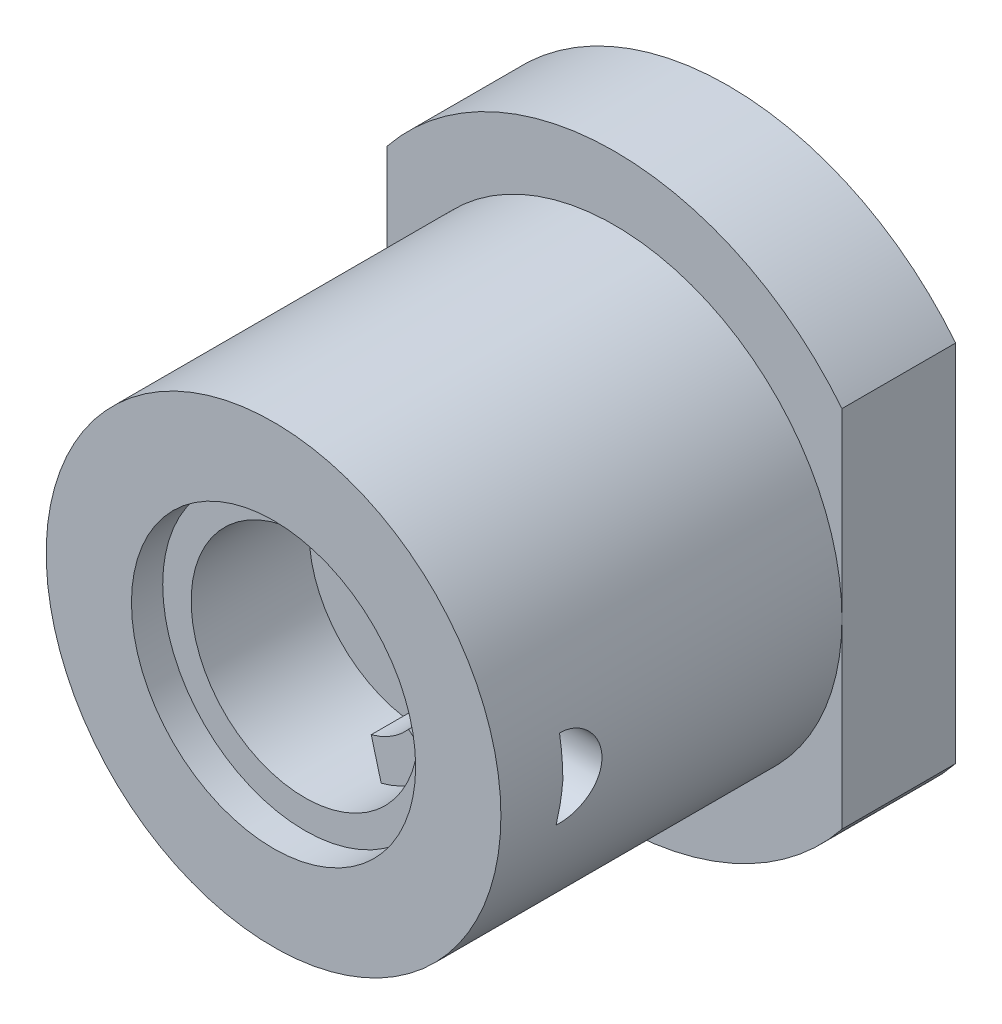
ISO-10303-21;
HEADER;
FILE_DESCRIPTION(('STEP AP214'),'2;1');
FILE_NAME('part.step','',(''),(''),'','','');
FILE_SCHEMA(('AUTOMOTIVE_DESIGN { 1 0 10303 214 1 1 1 1 }'));
ENDSEC;
DATA;
#1=APPLICATION_CONTEXT('core data for automotive mechanical design processes');
#2=APPLICATION_PROTOCOL_DEFINITION('international standard','automotive_design',2000,#1);
#3=PRODUCT_CONTEXT('',#1,'mechanical');
#4=PRODUCT('Part','Part','',(#3));
#5=PRODUCT_RELATED_PRODUCT_CATEGORY('part','',(#4));
#6=PRODUCT_DEFINITION_FORMATION('','',#4);
#7=PRODUCT_DEFINITION_CONTEXT('part definition',#1,'design');
#8=PRODUCT_DEFINITION('design','',#6,#7);
#9=PRODUCT_DEFINITION_SHAPE('','',#8);
#10=(LENGTH_UNIT() NAMED_UNIT(*) SI_UNIT(.MILLI.,.METRE.));
#11=(NAMED_UNIT(*) PLANE_ANGLE_UNIT() SI_UNIT($,.RADIAN.));
#12=(NAMED_UNIT(*) SI_UNIT($,.STERADIAN.) SOLID_ANGLE_UNIT());
#13=UNCERTAINTY_MEASURE_WITH_UNIT(LENGTH_MEASURE(1.E-05),#10,'distance_accuracy_value','');
#14=(GEOMETRIC_REPRESENTATION_CONTEXT(3) GLOBAL_UNCERTAINTY_ASSIGNED_CONTEXT((#13)) GLOBAL_UNIT_ASSIGNED_CONTEXT((#10,
#11,#12)) REPRESENTATION_CONTEXT('',''));
#15=CARTESIAN_POINT('',(0.,0.,0.));
#16=DIRECTION('',(0.,0.,1.));
#17=DIRECTION('',(1.,0.,0.));
#18=AXIS2_PLACEMENT_3D('',#15,#16,#17);
#19=CARTESIAN_POINT('',(0.,0.,13.5));
#20=DIRECTION('',(0.,0.,1.));
#21=DIRECTION('',(1.,0.,0.));
#22=AXIS2_PLACEMENT_3D('',#19,#20,#21);
#23=CYLINDRICAL_SURFACE('',#22,8.);
#24=DIRECTION('',(0.,0.,-1.));
#25=VECTOR('',#24,1.);
#26=CARTESIAN_POINT('',(6.03993550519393,-5.24587257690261,18.5));
#27=LINE('',#26,#25);
#28=CARTESIAN_POINT('',(6.03993550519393,-5.24587257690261,18.5));
#29=VERTEX_POINT('',#28);
#30=CARTESIAN_POINT('',(6.03993550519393,-5.24587257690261,13.5));
#31=VERTEX_POINT('',#30);
#32=EDGE_CURVE('E208',#29,#31,#27,.T.);
#33=ORIENTED_EDGE('',*,*,#32,.F.);
#34=CARTESIAN_POINT('',(0.,0.,18.5));
#35=DIRECTION('',(0.,0.,1.));
#36=DIRECTION('',(1.,0.,0.));
#37=AXIS2_PLACEMENT_3D('',#34,#35,#36);
#38=CIRCLE('',#37,8.);
#39=CARTESIAN_POINT('',(2.07387875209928,-7.72651453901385,18.5));
#40=VERTEX_POINT('',#39);
#41=EDGE_CURVE('E191',#40,#29,#38,.T.);
#42=ORIENTED_EDGE('',*,*,#41,.F.);
#43=DIRECTION('',(0.,0.,-1.));
#44=VECTOR('',#43,1.);
#45=CARTESIAN_POINT('',(2.07387875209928,-7.72651453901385,18.5));
#46=LINE('',#45,#44);
#47=CARTESIAN_POINT('',(2.07387875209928,-7.72651453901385,13.5));
#48=VERTEX_POINT('',#47);
#49=EDGE_CURVE('E200',#40,#48,#46,.T.);
#50=ORIENTED_EDGE('',*,*,#49,.T.);
#51=CARTESIAN_POINT('',(0.,0.,13.5));
#52=DIRECTION('',(0.,0.,1.));
#53=DIRECTION('',(1.,0.,0.));
#54=AXIS2_PLACEMENT_3D('',#51,#52,#53);
#55=CIRCLE('',#54,8.);
#56=EDGE_CURVE('E210',#31,#48,#55,.T.);
#57=ORIENTED_EDGE('',*,*,#56,.F.);
#58=EDGE_LOOP('',(#33,#42,#50,#57));
#59=FACE_BOUND('',#58,.T.);
#60=CARTESIAN_POINT('',(0.,0.,21.8));
#61=DIRECTION('',(0.,0.,1.));
#62=DIRECTION('',(1.,0.,0.));
#63=AXIS2_PLACEMENT_3D('',#60,#61,#62);
#64=CIRCLE('',#63,8.);
#65=CARTESIAN_POINT('',(8.,0.,21.8));
#66=VERTEX_POINT('',#65);
#67=EDGE_CURVE('E213',#66,#66,#64,.T.);
#68=ORIENTED_EDGE('',*,*,#67,.T.);
#69=EDGE_LOOP('',(#68));
#70=FACE_BOUND('',#69,.T.);
#71=CARTESIAN_POINT('',(7.99834418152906,-0.162756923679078,15.030893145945));
#72=CARTESIAN_POINT('',(7.99804089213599,-0.17766315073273,15.0447095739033));
#73=CARTESIAN_POINT('',(7.99772346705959,-0.191230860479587,15.0599867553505));
#74=CARTESIAN_POINT('',(7.99709907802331,-0.215772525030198,15.0925420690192));
#75=CARTESIAN_POINT('',(7.99679216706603,-0.226734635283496,15.1098288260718));
#76=CARTESIAN_POINT('',(7.99609880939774,-0.250187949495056,15.1530490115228));
#77=CARTESIAN_POINT('',(7.99573098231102,-0.26147906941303,15.1796332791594));
#78=CARTESIAN_POINT('',(7.99511354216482,-0.279715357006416,15.2342207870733));
#79=CARTESIAN_POINT('',(7.99486404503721,-0.286656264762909,15.2622253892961));
#80=CARTESIAN_POINT('',(7.99445546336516,-0.297864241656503,15.3263707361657));
#81=CARTESIAN_POINT('',(7.99433726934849,-0.30095214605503,15.3627185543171));
#82=CARTESIAN_POINT('',(7.99433010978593,-0.301140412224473,15.4354406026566));
#83=CARTESIAN_POINT('',(7.99444128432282,-0.298237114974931,15.4718148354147));
#84=CARTESIAN_POINT('',(7.99484122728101,-0.287293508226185,15.5379271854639));
#85=CARTESIAN_POINT('',(7.99509942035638,-0.280129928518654,15.5678116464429));
#86=CARTESIAN_POINT('',(7.99574109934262,-0.26118279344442,15.6260731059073));
#87=CARTESIAN_POINT('',(7.99612431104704,-0.249409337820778,15.6544532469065));
#88=CARTESIAN_POINT('',(7.99681716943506,-0.225828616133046,15.6988258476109));
#89=CARTESIAN_POINT('',(7.99710424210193,-0.215533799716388,15.7156238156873));
#90=CARTESIAN_POINT('',(7.99768932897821,-0.192606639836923,15.7475567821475));
#91=CARTESIAN_POINT('',(7.99798732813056,-0.179977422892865,15.7626939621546));
#92=CARTESIAN_POINT('',(7.99849252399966,-0.155647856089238,15.7870791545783));
#93=CARTESIAN_POINT('',(7.99870401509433,-0.144484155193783,15.7968596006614));
#94=CARTESIAN_POINT('',(7.99909750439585,-0.120745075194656,15.8145354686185));
#95=CARTESIAN_POINT('',(7.99927954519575,-0.108171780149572,15.8224336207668));
#96=CARTESIAN_POINT('',(7.9995627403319,-0.084317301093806,15.8344884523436));
#97=CARTESIAN_POINT('',(7.99967272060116,-0.0732536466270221,15.8390727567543));
#98=CARTESIAN_POINT('',(7.9998485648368,-0.0505148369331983,15.8463370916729));
#99=CARTESIAN_POINT('',(7.99991446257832,-0.0388401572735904,15.8490185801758));
#100=CARTESIAN_POINT('',(7.99999446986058,-0.0151427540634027,15.8522682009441));
#101=CARTESIAN_POINT('',(8.00000835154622,-0.00311873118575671,15.8528270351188));
#102=CARTESIAN_POINT('',(7.99998184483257,0.020830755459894,15.8517542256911));
#103=CARTESIAN_POINT('',(7.99994145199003,0.0327562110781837,15.8501224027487));
#104=CARTESIAN_POINT('',(7.99981588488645,0.0553669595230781,15.8449876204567));
#105=CARTESIAN_POINT('',(7.99973381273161,0.0660823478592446,15.8416140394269));
#106=CARTESIAN_POINT('',(7.99953496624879,0.0868834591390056,15.833305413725));
#107=CARTESIAN_POINT('',(7.99941817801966,0.0969689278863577,15.8283697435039));
#108=CARTESIAN_POINT('',(7.99910343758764,0.120571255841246,15.8147794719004));
#109=CARTESIAN_POINT('',(7.99889220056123,0.133692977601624,15.8054389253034));
#110=CARTESIAN_POINT('',(7.9984437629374,0.158269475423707,15.784776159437));
#111=CARTESIAN_POINT('',(7.99820650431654,0.169720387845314,15.7734494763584));
#112=CARTESIAN_POINT('',(7.99761972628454,0.195747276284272,15.7439749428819));
#113=CARTESIAN_POINT('',(7.99726745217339,0.209430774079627,15.7250418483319));
#114=CARTESIAN_POINT('',(7.99659548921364,0.233681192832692,15.6852909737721));
#115=CARTESIAN_POINT('',(7.99627586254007,0.244242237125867,15.6644697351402));
#116=CARTESIAN_POINT('',(7.9955733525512,0.266419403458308,15.6125406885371));
#117=CARTESIAN_POINT('',(7.9952210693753,0.276585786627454,15.5808131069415));
#118=CARTESIAN_POINT('',(7.99468228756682,0.291736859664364,15.5161537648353));
#119=CARTESIAN_POINT('',(7.99449598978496,0.296715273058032,15.4832205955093));
#120=CARTESIAN_POINT('',(7.99430790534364,0.301741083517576,15.416236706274));
#121=CARTESIAN_POINT('',(7.99431035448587,0.301675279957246,15.3821774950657));
#122=CARTESIAN_POINT('',(7.99451468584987,0.296215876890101,15.314491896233));
#123=CARTESIAN_POINT('',(7.99471637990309,0.290827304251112,15.2808651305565));
#124=CARTESIAN_POINT('',(7.99523035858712,0.276277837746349,15.2229300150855));
#125=CARTESIAN_POINT('',(7.99550465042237,0.268327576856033,15.1983166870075));
#126=CARTESIAN_POINT('',(7.99613711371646,0.248773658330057,15.1505753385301));
#127=CARTESIAN_POINT('',(7.99649515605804,0.237175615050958,15.1274451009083));
#128=CARTESIAN_POINT('',(7.9971471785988,0.213846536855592,15.0899457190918));
#129=CARTESIAN_POINT('',(7.99743017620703,0.203103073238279,15.074963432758));
#130=CARTESIAN_POINT('',(7.99799621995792,0.179433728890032,15.0468249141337));
#131=CARTESIAN_POINT('',(7.99827926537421,0.16651118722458,15.033665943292));
#132=CARTESIAN_POINT('',(7.99875298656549,0.141660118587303,15.0126235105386));
#133=CARTESIAN_POINT('',(7.9989500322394,0.130173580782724,15.0042208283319));
#134=CARTESIAN_POINT('',(7.99930708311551,0.105981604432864,14.9893812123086));
#135=CARTESIAN_POINT('',(7.99946710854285,0.0932768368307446,14.9829432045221));
#136=CARTESIAN_POINT('',(7.99973241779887,0.0667685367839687,14.9724330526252));
#137=CARTESIAN_POINT('',(7.99983717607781,0.0529558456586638,14.9683835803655));
#138=CARTESIAN_POINT('',(7.99997388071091,0.0248011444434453,14.9631226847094));
#139=CARTESIAN_POINT('',(8.00000590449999,0.0104597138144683,14.9619082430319));
#140=CARTESIAN_POINT('',(7.9999932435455,-0.016063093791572,14.962392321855));
#141=CARTESIAN_POINT('',(7.99995909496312,-0.0282535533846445,14.9636907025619));
#142=CARTESIAN_POINT('',(7.99983843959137,-0.0522377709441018,14.9683359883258));
#143=CARTESIAN_POINT('',(7.99975191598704,-0.0640314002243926,14.9716835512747));
#144=CARTESIAN_POINT('',(7.99953660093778,-0.0868558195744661,14.9801756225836));
#145=CARTESIAN_POINT('',(7.9994080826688,-0.0978909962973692,14.9853085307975));
#146=CARTESIAN_POINT('',(7.99912044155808,-0.119099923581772,14.9970941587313));
#147=CARTESIAN_POINT('',(7.99896133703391,-0.129274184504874,15.0037459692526));
#148=CARTESIAN_POINT('',(7.99864904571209,-0.147247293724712,15.0172162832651));
#149=CARTESIAN_POINT('',(7.99849844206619,-0.155175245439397,15.0238657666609));
#150=CARTESIAN_POINT('',(7.99834418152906,-0.162756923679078,15.030893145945));
#151=B_SPLINE_CURVE_WITH_KNOTS('',3,(#71,#72,#73,#74,#75,#76,#77,#78,#79,#80,#81,#82,#83,#84,
#85,#86,#87,#88,#89,#90,#91,#92,#93,#94,#95,#96,#97,#98,#99,#100,#101,#102,#103,#104,#105,#106,
#107,#108,#109,#110,#111,#112,#113,#114,#115,#116,#117,#118,#119,#120,#121,#122,#123,#124,#125,
#126,#127,#128,#129,#130,#131,#132,#133,#134,#135,#136,#137,#138,#139,#140,#141,#142,#143,#144,
#145,#146,#147,#148,#149,#150),.UNSPECIFIED.,.T.,.F.,(4,2,2,2,2,2,2,2,2,2,2,2,2,2,2,2,2,2,2,2,2,
2,2,2,2,2,2,2,2,2,2,2,2,2,2,2,2,2,2,4),(0.,0.0609429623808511,0.122157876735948,
0.208341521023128,0.294609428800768,0.403509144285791,0.512475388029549,0.604358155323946,
0.696040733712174,0.75499410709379,0.813869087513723,0.85825101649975,0.90256817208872,
0.938350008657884,0.974104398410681,1.01001522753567,1.04592899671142,1.07949355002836,
1.11307156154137,1.16112539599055,1.20928864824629,1.27899025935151,1.34882223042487,
1.44824942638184,1.54779677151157,1.64957876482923,1.75126472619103,1.82862776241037,
1.90587230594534,1.96101507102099,2.0160740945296,2.0586150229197,2.10113265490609,
2.14404762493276,2.18691688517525,2.22351492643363,2.26012472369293,2.29650096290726,
2.332855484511,2.3638525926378),.UNSPECIFIED.);
#152=CARTESIAN_POINT('',(7.99834418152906,-0.162756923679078,15.030893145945));
#153=VERTEX_POINT('',#152);
#154=EDGE_CURVE('E146',#153,#153,#151,.T.);
#155=ORIENTED_EDGE('',*,*,#154,.F.);
#156=EDGE_LOOP('',(#155));
#157=FACE_BOUND('',#156,.T.);
#158=ADVANCED_FACE('F31',(#59,#70,#157),#23,.F.);
#159=CARTESIAN_POINT('',(12.74,0.00999999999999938,19.64));
#160=DIRECTION('',(0.,0.,-1.));
#161=DIRECTION('',(0.,1.,0.));
#162=AXIS2_PLACEMENT_3D('',#159,#160,#161);
#163=PLANE('',#162);
#164=DIRECTION('',(1.,0.,0.));
#165=VECTOR('',#164,1.);
#166=CARTESIAN_POINT('',(16.,0.,19.64));
#167=LINE('',#166,#165);
#168=CARTESIAN_POINT('',(10.3146114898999,0.,19.64));
#169=VERTEX_POINT('',#168);
#170=CARTESIAN_POINT('',(16.,0.,19.64));
#171=VERTEX_POINT('',#170);
#172=EDGE_CURVE('E54',#169,#171,#167,.T.);
#173=ORIENTED_EDGE('',*,*,#172,.F.);
#174=DIRECTION('',(0.,1.,0.));
#175=VECTOR('',#174,1.);
#176=CARTESIAN_POINT('',(10.3146114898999,0.00999999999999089,19.64));
#177=LINE('',#176,#175);
#178=CARTESIAN_POINT('',(10.3146114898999,0.586109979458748,19.64));
#179=VERTEX_POINT('',#178);
#180=EDGE_CURVE('E150',#169,#179,#177,.T.);
#181=ORIENTED_EDGE('',*,*,#180,.T.);
#182=CARTESIAN_POINT('',(13.1445109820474,0.,19.64));
#183=DIRECTION('',(0.,0.,-1.));
#184=DIRECTION('',(1.,0.,0.));
#185=AXIS2_PLACEMENT_3D('',#182,#183,#184);
#186=ELLIPSE('',#185,2.95779046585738,2.01499486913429);
#187=CARTESIAN_POINT('',(10.18672051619,0.,19.64));
#188=VERTEX_POINT('',#187);
#189=EDGE_CURVE('E138',#179,#188,#186,.F.);
#190=ORIENTED_EDGE('',*,*,#189,.T.);
#191=CARTESIAN_POINT('',(10.,0.,19.64));
#192=VERTEX_POINT('',#191);
#193=EDGE_CURVE('E177',#192,#188,#167,.T.);
#194=ORIENTED_EDGE('',*,*,#193,.F.);
#195=DIRECTION('',(-1.73472347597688E-13,-1.,0.));
#196=VECTOR('',#195,1.);
#197=CARTESIAN_POINT('',(10.,0.,19.64));
#198=LINE('',#197,#196);
#199=CARTESIAN_POINT('',(10.,0.00999999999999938,19.64));
#200=VERTEX_POINT('',#199);
#201=EDGE_CURVE('E174',#200,#192,#198,.T.);
#202=ORIENTED_EDGE('',*,*,#201,.F.);
#203=CARTESIAN_POINT('',(12.74,0.00999999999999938,19.64));
#204=DIRECTION('',(0.,0.,1.));
#205=DIRECTION('',(0.,1.,0.));
#206=AXIS2_PLACEMENT_3D('',#203,#204,#205);
#207=CIRCLE('',#206,2.74);
#208=CARTESIAN_POINT('',(12.74,2.75,19.64));
#209=VERTEX_POINT('',#208);
#210=EDGE_CURVE('E171',#209,#200,#207,.T.);
#211=ORIENTED_EDGE('',*,*,#210,.F.);
#212=DIRECTION('',(-1.,0.,0.));
#213=VECTOR('',#212,1.);
#214=CARTESIAN_POINT('',(16.,2.75,19.64));
#215=LINE('',#214,#213);
#216=CARTESIAN_POINT('',(15.7619002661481,2.75,19.64));
#217=VERTEX_POINT('',#216);
#218=EDGE_CURVE('E169',#217,#209,#215,.T.);
#219=ORIENTED_EDGE('',*,*,#218,.F.);
#220=CARTESIAN_POINT('',(0.,0.,19.64));
#221=DIRECTION('',(0.,0.,-1.));
#222=DIRECTION('',(0.,1.,0.));
#223=AXIS2_PLACEMENT_3D('',#220,#221,#222);
#224=CIRCLE('',#223,16.);
#225=EDGE_CURVE('E263',#217,#171,#224,.T.);
#226=ORIENTED_EDGE('',*,*,#225,.T.);
#227=EDGE_LOOP('',(#173,#181,#190,#194,#202,#211,#219,#226));
#228=FACE_BOUND('',#227,.T.);
#229=ADVANCED_FACE('F153',(#228),#163,.T.);
#230=CARTESIAN_POINT('',(12.74,-0.0099619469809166,19.6408715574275));
#231=DIRECTION('',(0.,0.0871557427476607,0.996194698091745));
#232=DIRECTION('',(0.,-0.996194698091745,0.0871557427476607));
#233=AXIS2_PLACEMENT_3D('',#230,#231,#232);
#234=PLANE('',#233);
#235=DIRECTION('',(-0.08682659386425,-0.992432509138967,0.0868265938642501));
#236=VECTOR('',#235,1.);
#237=CARTESIAN_POINT('',(10.3320311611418,0.19910775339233,19.6225803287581));
#238=LINE('',#237,#236);
#239=CARTESIAN_POINT('',(10.2768135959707,-0.432031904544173,19.6777978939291));
#240=VERTEX_POINT('',#239);
#241=EDGE_CURVE('E11',#169,#240,#238,.T.);
#242=ORIENTED_EDGE('',*,*,#241,.F.);
#243=ORIENTED_EDGE('',*,*,#172,.T.);
#244=CARTESIAN_POINT('',(0.,0.,19.64));
#245=DIRECTION('',(0.,0.0871557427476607,0.996194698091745));
#246=DIRECTION('',(0.,0.996194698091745,-0.0871557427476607));
#247=AXIS2_PLACEMENT_3D('',#244,#245,#246);
#248=ELLIPSE('',#247,16.0611174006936,16.);
#249=CARTESIAN_POINT('',(15.763722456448,-2.7395354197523,19.8796782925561));
#250=VERTEX_POINT('',#249);
#251=EDGE_CURVE('E258',#250,#171,#248,.T.);
#252=ORIENTED_EDGE('',*,*,#251,.F.);
#253=DIRECTION('',(-1.,0.,0.));
#254=VECTOR('',#253,1.);
#255=CARTESIAN_POINT('',(16.,-2.7395354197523,19.8796782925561));
#256=LINE('',#255,#254);
#257=CARTESIAN_POINT('',(12.74,-2.7395354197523,19.8796782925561));
#258=VERTEX_POINT('',#257);
#259=EDGE_CURVE('E154',#250,#258,#256,.T.);
#260=ORIENTED_EDGE('',*,*,#259,.T.);
#261=CARTESIAN_POINT('',(12.74,-0.0099619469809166,19.6408715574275));
#262=DIRECTION('',(0.,-0.0871557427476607,-0.996194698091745));
#263=DIRECTION('',(0.,-0.996194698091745,0.0871557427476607));
#264=AXIS2_PLACEMENT_3D('',#261,#262,#263);
#265=CIRCLE('',#264,2.74);
#266=CARTESIAN_POINT('',(10.,-0.0099619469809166,19.6408715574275));
#267=VERTEX_POINT('',#266);
#268=EDGE_CURVE('E156',#258,#267,#265,.T.);
#269=ORIENTED_EDGE('',*,*,#268,.T.);
#270=DIRECTION('',(-1.73472347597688E-13,0.996194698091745,-0.0871557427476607));
#271=VECTOR('',#270,1.);
#272=CARTESIAN_POINT('',(10.,0.,19.64));
#273=LINE('',#272,#271);
#274=EDGE_CURVE('E167',#267,#192,#273,.T.);
#275=ORIENTED_EDGE('',*,*,#274,.T.);
#276=ORIENTED_EDGE('',*,*,#193,.T.);
#277=CARTESIAN_POINT('',(13.1515240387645,-0.0694202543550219,19.6460734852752));
#278=DIRECTION('',(0.,0.0871557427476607,0.996194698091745));
#279=DIRECTION('',(0.996223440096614,-0.0864961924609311,0.00756743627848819));
#280=AXIS2_PLACEMENT_3D('',#277,#278,#279);
#281=ELLIPSE('',#280,2.97260866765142,2.01618892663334);
#282=EDGE_CURVE('E141',#240,#188,#281,.F.);
#283=ORIENTED_EDGE('',*,*,#282,.F.);
#284=EDGE_LOOP('',(#242,#243,#252,#260,#269,#275,#276,#283));
#285=FACE_BOUND('',#284,.T.);
#286=ADVANCED_FACE('F284',(#285),#234,.F.);
#287=CARTESIAN_POINT('',(12.74,0.,19.64));
#288=DIRECTION('',(-1.,0.,0.));
#289=DIRECTION('',(0.,0.,1.));
#290=AXIS2_PLACEMENT_3D('',#287,#288,#289);
#291=DEGENERATE_TOROIDAL_SURFACE('',#290,0.00999999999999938,2.74,.T.);
#292=CARTESIAN_POINT('',(12.74,0.,19.64));
#293=DIRECTION('',(-1.,0.,0.));
#294=DIRECTION('',(0.,0.,1.));
#295=AXIS2_PLACEMENT_3D('',#292,#293,#294);
#296=CIRCLE('',#295,2.75);
#297=EDGE_CURVE('E179',#209,#258,#296,.T.);
#298=ORIENTED_EDGE('',*,*,#297,.F.);
#299=ORIENTED_EDGE('',*,*,#210,.T.);
#300=CARTESIAN_POINT('',(10.,0.,19.64));
#301=DIRECTION('',(-1.,0.,0.));
#302=DIRECTION('',(0.,0.,1.));
#303=AXIS2_PLACEMENT_3D('',#300,#301,#302);
#304=CIRCLE('',#303,0.00999999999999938);
#305=EDGE_CURVE('E182',#200,#267,#304,.T.);
#306=ORIENTED_EDGE('',*,*,#305,.T.);
#307=ORIENTED_EDGE('',*,*,#268,.F.);
#308=EDGE_LOOP('',(#298,#299,#306,#307));
#309=FACE_BOUND('',#308,.T.);
#310=CARTESIAN_POINT('',(11.3195956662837,-1.14825759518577,17.5860969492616));
#311=CARTESIAN_POINT('',(11.273049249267,-1.19919576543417,17.6469061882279));
#312=CARTESIAN_POINT('',(11.2234334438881,-1.24264167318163,17.7118679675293));
#313=CARTESIAN_POINT('',(11.1201315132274,-1.31280832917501,17.8475140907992));
#314=CARTESIAN_POINT('',(11.0664369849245,-1.33949343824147,17.9182102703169));
#315=CARTESIAN_POINT('',(10.9649126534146,-1.37261209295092,18.0523162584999));
#316=CARTESIAN_POINT('',(10.9173260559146,-1.38137418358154,18.1153443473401));
#317=CARTESIAN_POINT('',(10.8221609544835,-1.38562731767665,18.241770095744));
#318=CARTESIAN_POINT('',(10.7745824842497,-1.38113070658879,18.3051673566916));
#319=CARTESIAN_POINT('',(10.6803251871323,-1.35893237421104,18.4311667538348));
#320=CARTESIAN_POINT('',(10.6336576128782,-1.34111744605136,18.4937573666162));
#321=CARTESIAN_POINT('',(10.5429590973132,-1.29263592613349,18.6158167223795));
#322=CARTESIAN_POINT('',(10.4989286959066,-1.2619667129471,18.6752848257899));
#323=CARTESIAN_POINT('',(10.4147586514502,-1.18860385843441,18.7893691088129));
#324=CARTESIAN_POINT('',(10.3746191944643,-1.14590964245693,18.8439850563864));
#325=CARTESIAN_POINT('',(10.2993812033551,-1.04966195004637,18.9467353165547));
#326=CARTESIAN_POINT('',(10.2642822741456,-0.996109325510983,18.9948701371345));
#327=CARTESIAN_POINT('',(10.200408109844,-0.880118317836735,19.0828087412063));
#328=CARTESIAN_POINT('',(10.1715823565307,-0.817758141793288,19.1226789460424));
#329=CARTESIAN_POINT('',(10.1207207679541,-0.685559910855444,19.1933346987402));
#330=CARTESIAN_POINT('',(10.0986849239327,-0.615721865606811,19.2241202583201));
#331=CARTESIAN_POINT('',(10.0623097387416,-0.471607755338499,19.2752134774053));
#332=CARTESIAN_POINT('',(10.0478661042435,-0.397408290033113,19.2956629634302));
#333=CARTESIAN_POINT('',(10.0266124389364,-0.245833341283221,19.3260100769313));
#334=CARTESIAN_POINT('',(10.0198005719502,-0.168458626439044,19.3359102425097));
#335=CARTESIAN_POINT('',(10.013897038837,-0.01406816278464,19.3444684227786));
#336=CARTESIAN_POINT('',(10.0146810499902,0.0629327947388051,19.3433074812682));
#337=CARTESIAN_POINT('',(10.0236843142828,0.215581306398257,19.3302810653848));
#338=CARTESIAN_POINT('',(10.03190402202,0.291228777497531,19.3184149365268));
#339=CARTESIAN_POINT('',(10.0555723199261,0.438417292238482,19.2847432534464));
#340=CARTESIAN_POINT('',(10.0709604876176,0.509987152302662,19.2630208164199));
#341=CARTESIAN_POINT('',(10.108524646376,0.647752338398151,19.2103675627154));
#342=CARTESIAN_POINT('',(10.1307007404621,0.713947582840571,19.1794366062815));
#343=CARTESIAN_POINT('',(10.1816799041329,0.840297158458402,19.1087036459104));
#344=CARTESIAN_POINT('',(10.2105909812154,0.900327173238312,19.0687574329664));
#345=CARTESIAN_POINT('',(10.2740170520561,1.01141175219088,18.9815119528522));
#346=CARTESIAN_POINT('',(10.3085325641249,1.06246548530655,18.9342120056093));
#347=CARTESIAN_POINT('',(10.3827807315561,1.15495194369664,18.8328716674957));
#348=CARTESIAN_POINT('',(10.4225836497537,1.19622947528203,18.7787411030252));
#349=CARTESIAN_POINT('',(10.5058962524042,1.26707685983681,18.6658672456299));
#350=CARTESIAN_POINT('',(10.5494061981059,1.29664588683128,18.607123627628));
#351=CARTESIAN_POINT('',(10.6394760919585,1.3435775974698,18.4859463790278));
#352=CARTESIAN_POINT('',(10.6860662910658,1.36079008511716,18.4234770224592));
#353=CARTESIAN_POINT('',(10.7805111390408,1.38195713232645,18.297259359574));
#354=CARTESIAN_POINT('',(10.8283658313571,1.38591123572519,18.2335110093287));
#355=CARTESIAN_POINT('',(10.9242015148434,1.3804216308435,18.1062287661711));
#356=CARTESIAN_POINT('',(10.9721820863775,1.3709167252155,18.0426971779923));
#357=CARTESIAN_POINT('',(11.0666555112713,1.33862813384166,17.9179412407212));
#358=CARTESIAN_POINT('',(11.1131483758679,1.31584454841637,17.8567168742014));
#359=CARTESIAN_POINT('',(11.2031018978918,1.25770217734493,17.7385409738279));
#360=CARTESIAN_POINT('',(11.2465730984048,1.2223900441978,17.6815745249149));
#361=CARTESIAN_POINT('',(11.3293603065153,1.14012730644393,17.5733045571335));
#362=CARTESIAN_POINT('',(11.3686765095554,1.09317724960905,17.5220007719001));
#363=CARTESIAN_POINT('',(11.44159600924,0.98943463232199,17.4270049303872));
#364=CARTESIAN_POINT('',(11.4752496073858,0.932738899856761,17.3832457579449));
#365=CARTESIAN_POINT('',(11.5362467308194,0.810794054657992,17.3040334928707));
#366=CARTESIAN_POINT('',(11.5635906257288,0.745545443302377,17.2685799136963));
#367=CARTESIAN_POINT('',(11.6108421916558,0.609121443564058,17.2073703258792));
#368=CARTESIAN_POINT('',(11.6308285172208,0.538019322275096,17.1815117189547));
#369=CARTESIAN_POINT('',(11.6631562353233,0.391305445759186,17.1397084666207));
#370=CARTESIAN_POINT('',(11.6754979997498,0.315693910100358,17.1237633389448));
#371=CARTESIAN_POINT('',(11.6920732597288,0.162805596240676,17.1023527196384));
#372=CARTESIAN_POINT('',(11.6963754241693,0.0855486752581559,17.0967984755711));
#373=CARTESIAN_POINT('',(11.696945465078,-0.0690384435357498,17.0960624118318));
#374=CARTESIAN_POINT('',(11.6932140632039,-0.146368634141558,17.1008796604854));
#375=CARTESIAN_POINT('',(11.6778640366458,-0.298622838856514,17.120706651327));
#376=CARTESIAN_POINT('',(11.6662737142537,-0.373554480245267,17.1356798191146));
#377=CARTESIAN_POINT('',(11.6355879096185,-0.519217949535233,17.1753553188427));
#378=CARTESIAN_POINT('',(11.6164896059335,-0.589948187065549,17.2000613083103));
#379=CARTESIAN_POINT('',(11.5713042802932,-0.725430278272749,17.2585827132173));
#380=CARTESIAN_POINT('',(11.5451934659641,-0.790160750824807,17.2924291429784));
#381=CARTESIAN_POINT('',(11.4868343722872,-0.911509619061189,17.3681916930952));
#382=CARTESIAN_POINT('',(11.4545967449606,-0.968141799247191,17.4100938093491));
#383=CARTESIAN_POINT('',(11.4040892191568,-1.04336576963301,17.4758617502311));
#384=CARTESIAN_POINT('',(11.3878537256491,-1.06578823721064,17.4970181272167));
#385=CARTESIAN_POINT('',(11.3544243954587,-1.10858515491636,17.5406164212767));
#386=CARTESIAN_POINT('',(11.3372303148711,-1.12895908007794,17.5630586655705));
#387=CARTESIAN_POINT('',(11.3195956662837,-1.14825759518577,17.5860969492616));
#388=B_SPLINE_CURVE_WITH_KNOTS('',3,(#310,#311,#312,#313,#314,#315,#316,#317,#318,#319,#320,
#321,#322,#323,#324,#325,#326,#327,#328,#329,#330,#331,#332,#333,#334,#335,#336,#337,#338,#339,
#340,#341,#342,#343,#344,#345,#346,#347,#348,#349,#350,#351,#352,#353,#354,#355,#356,#357,#358,
#359,#360,#361,#362,#363,#364,#365,#366,#367,#368,#369,#370,#371,#372,#373,#374,#375,#376,#377,
#378,#379,#380,#381,#382,#383,#384,#385,#386,#387),.UNSPECIFIED.,.T.,.F.,(4,2,2,2,2,2,2,2,2,2,2,
2,2,2,2,2,2,2,2,2,2,2,2,2,2,2,2,2,2,2,2,2,2,2,2,2,2,2,4),(0.,0.275745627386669,
0.552075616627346,0.789364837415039,1.02643318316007,1.26553987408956,1.50469535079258,
1.74386225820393,1.98301040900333,2.22015489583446,2.4572990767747,2.69109437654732,
2.92483341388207,3.15475336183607,3.38468736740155,3.61271740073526,3.84075089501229,
4.0727292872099,4.30472914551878,4.54019633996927,4.77568014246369,5.0139799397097,
5.25228793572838,5.49168299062,5.73107623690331,5.96958725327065,6.20808704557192,
6.44434138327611,6.68058187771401,6.91421803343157,7.14784282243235,7.37946285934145,
7.61106209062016,7.84183166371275,8.07268804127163,8.30433779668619,8.53558843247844,
8.64003115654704,8.74450057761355),.UNSPECIFIED.);
#389=CARTESIAN_POINT('',(11.3195956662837,-1.14825759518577,17.5860969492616));
#390=VERTEX_POINT('',#389);
#391=EDGE_CURVE('E151',#390,#390,#388,.T.);
#392=ORIENTED_EDGE('',*,*,#391,.T.);
#393=EDGE_LOOP('',(#392));
#394=FACE_BOUND('',#393,.T.);
#395=ADVANCED_FACE('F280',(#309,#394),#291,.F.);
#396=CARTESIAN_POINT('',(0.,0.,24.));
#397=DIRECTION('',(0.,0.,-1.));
#398=DIRECTION('',(-1.,0.,0.));
#399=AXIS2_PLACEMENT_3D('',#396,#397,#398);
#400=CYLINDRICAL_SURFACE('',#399,16.);
#401=CARTESIAN_POINT('',(0.,0.,0.));
#402=DIRECTION('',(0.,0.,-1.));
#403=DIRECTION('',(-1.,0.,0.));
#404=AXIS2_PLACEMENT_3D('',#401,#402,#403);
#405=CIRCLE('',#404,16.);
#406=CARTESIAN_POINT('',(16.,0.,0.));
#407=VERTEX_POINT('',#406);
#408=CARTESIAN_POINT('',(-16.,0.,0.));
#409=VERTEX_POINT('',#408);
#410=EDGE_CURVE('E252',#407,#409,#405,.T.);
#411=ORIENTED_EDGE('',*,*,#410,.F.);
#412=EDGE_CURVE('E251',#409,#407,#405,.T.);
#413=ORIENTED_EDGE('',*,*,#412,.F.);
#414=EDGE_LOOP('',(#411,#413));
#415=FACE_BOUND('',#414,.T.);
#416=CARTESIAN_POINT('',(0.,0.,24.));
#417=DIRECTION('',(0.,0.,1.));
#418=DIRECTION('',(1.,0.,0.));
#419=AXIS2_PLACEMENT_3D('',#416,#417,#418);
#420=CIRCLE('',#419,16.);
#421=CARTESIAN_POINT('',(16.,0.,24.));
#422=VERTEX_POINT('',#421);
#423=EDGE_CURVE('E255',#422,#422,#420,.T.);
#424=ORIENTED_EDGE('',*,*,#423,.F.);
#425=EDGE_LOOP('',(#424));
#426=FACE_BOUND('',#425,.T.);
#427=CARTESIAN_POINT('',(15.763722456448,-2.7395354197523,19.8796782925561));
#428=CARTESIAN_POINT('',(15.7625576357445,-2.7462135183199,19.8034398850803));
#429=CARTESIAN_POINT('',(15.7619526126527,-2.74969352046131,19.7269166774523));
#430=CARTESIAN_POINT('',(15.7618547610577,-2.75026726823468,19.5738516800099));
#431=CARTESIAN_POINT('',(15.7623618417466,-2.74736153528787,19.4973098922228));
#432=CARTESIAN_POINT('',(15.7644792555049,-2.73518262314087,19.3448436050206));
#433=CARTESIAN_POINT('',(15.7660881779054,-2.72591758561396,19.2689184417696));
#434=CARTESIAN_POINT('',(15.7703562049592,-2.70111435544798,19.1181513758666));
#435=CARTESIAN_POINT('',(15.7730153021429,-2.68557620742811,19.0433094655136));
#436=CARTESIAN_POINT('',(15.7824656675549,-2.62968757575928,18.82115356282));
#437=CARTESIAN_POINT('',(15.7907313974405,-2.58005557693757,18.6761189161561));
#438=CARTESIAN_POINT('',(15.8102553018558,-2.45756684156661,18.3965387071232));
#439=CARTESIAN_POINT('',(15.8215134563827,-2.38471026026,18.2619930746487));
#440=CARTESIAN_POINT('',(15.8458655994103,-2.21714847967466,18.0058818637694));
#441=CARTESIAN_POINT('',(15.8589735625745,-2.1222730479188,17.8844288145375));
#442=CARTESIAN_POINT('',(15.8855008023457,-1.91360941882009,17.659041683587));
#443=CARTESIAN_POINT('',(15.8989201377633,-1.79981762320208,17.5551109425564));
#444=CARTESIAN_POINT('',(15.9247185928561,-1.55518146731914,17.3666803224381));
#445=CARTESIAN_POINT('',(15.9370859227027,-1.42417744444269,17.2823858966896));
#446=CARTESIAN_POINT('',(15.9592355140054,-1.14966769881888,17.1370255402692));
#447=CARTESIAN_POINT('',(15.9690180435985,-1.00616327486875,17.0759571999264));
#448=CARTESIAN_POINT('',(15.9848426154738,-0.711623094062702,16.9791781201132));
#449=CARTESIAN_POINT('',(15.9909072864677,-0.560639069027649,16.9433137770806));
#450=CARTESIAN_POINT('',(15.9987043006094,-0.25468326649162,16.8974537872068));
#451=CARTESIAN_POINT('',(16.00043690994,-0.0997117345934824,16.8874565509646));
#452=CARTESIAN_POINT('',(15.9993807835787,0.207744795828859,16.8936042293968));
#453=CARTESIAN_POINT('',(15.9966484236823,0.36023662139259,16.9094231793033));
#454=CARTESIAN_POINT('',(15.9870723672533,0.660353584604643,16.9660976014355));
#455=CARTESIAN_POINT('',(15.9802287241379,0.807978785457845,17.0069527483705));
#456=CARTESIAN_POINT('',(15.9631796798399,1.09429867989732,17.1124910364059));
#457=CARTESIAN_POINT('',(15.9529729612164,1.23298984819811,17.1771835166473));
#458=CARTESIAN_POINT('',(15.9303105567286,1.49762036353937,17.3285345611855));
#459=CARTESIAN_POINT('',(15.9178546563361,1.62355849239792,17.4151952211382));
#460=CARTESIAN_POINT('',(15.8918793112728,1.86081056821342,17.6093170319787));
#461=CARTESIAN_POINT('',(15.8783484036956,1.97191931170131,17.7170274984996));
#462=CARTESIAN_POINT('',(15.8518668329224,2.17457813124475,17.9495864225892));
#463=CARTESIAN_POINT('',(15.8389162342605,2.26612603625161,18.0744367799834));
#464=CARTESIAN_POINT('',(15.814981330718,2.42756861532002,18.3386430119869));
#465=CARTESIAN_POINT('',(15.8040093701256,2.49732921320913,18.4780819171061));
#466=CARTESIAN_POINT('',(15.7854086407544,2.61233512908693,18.7668921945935));
#467=CARTESIAN_POINT('',(15.7777773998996,2.65759858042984,18.9162561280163));
#468=CARTESIAN_POINT('',(15.7688581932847,2.70989161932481,19.1622637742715));
#469=CARTESIAN_POINT('',(15.7662605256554,2.72492260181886,19.2572325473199));
#470=CARTESIAN_POINT('',(15.7627772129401,2.74497497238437,19.4481192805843));
#471=CARTESIAN_POINT('',(15.7618892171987,2.75001010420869,19.5440357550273));
#472=CARTESIAN_POINT('',(15.7619002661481,2.75,19.64));
#473=B_SPLINE_CURVE_WITH_KNOTS('',3,(#427,#428,#429,#430,#431,#432,#433,#434,#435,#436,#437,
#438,#439,#440,#441,#442,#443,#444,#445,#446,#447,#448,#449,#450,#451,#452,#453,#454,#455,#456,
#457,#458,#459,#460,#461,#462,#463,#464,#465,#466,#467,#468,#469,#470,#471,#472),.UNSPECIFIED.,
.F.,.F.,(4,2,2,2,2,2,2,2,2,2,2,2,2,2,2,2,2,2,2,2,2,2,4),(0.,0.229542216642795,0.459065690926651,
0.688295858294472,0.917524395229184,1.37571253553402,1.83389761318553,2.29575052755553,
2.75769139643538,3.22426781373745,3.69079581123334,4.15445534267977,4.6180863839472,
5.07590860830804,5.5337248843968,5.99172071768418,6.44976025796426,6.91359540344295,
7.37748200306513,7.84416947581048,8.31051102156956,8.59857133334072,8.88623530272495),.UNSPECIFIED.);
#474=EDGE_CURVE('E40',#250,#217,#473,.T.);
#475=ORIENTED_EDGE('',*,*,#474,.F.);
#476=ORIENTED_EDGE('',*,*,#251,.T.);
#477=ORIENTED_EDGE('',*,*,#225,.F.);
#478=EDGE_LOOP('',(#475,#476,#477));
#479=FACE_BOUND('',#478,.T.);
#480=ADVANCED_FACE('F33',(#415,#426,#479),#400,.T.);
#481=CARTESIAN_POINT('',(0.,0.,13.5));
#482=DIRECTION('',(0.,0.,1.));
#483=DIRECTION('',(1.,0.,0.));
#484=AXIS2_PLACEMENT_3D('',#481,#482,#483);
#485=PLANE('',#484);
#486=CARTESIAN_POINT('',(0.,0.,13.5));
#487=DIRECTION('',(0.,0.,-1.));
#488=DIRECTION('',(1.,0.,0.));
#489=AXIS2_PLACEMENT_3D('',#486,#487,#488);
#490=CIRCLE('',#489,5.3);
#491=CARTESIAN_POINT('',(4.00145727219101,-3.47539058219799,13.5));
#492=VERTEX_POINT('',#491);
#493=CARTESIAN_POINT('',(1.3739446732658,-5.11881588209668,13.5));
#494=VERTEX_POINT('',#493);
#495=EDGE_CURVE('E186',#492,#494,#490,.T.);
#496=ORIENTED_EDGE('',*,*,#495,.F.);
#497=DIRECTION('',(-0.754991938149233,0.655734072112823,0.));
#498=VECTOR('',#497,1.);
#499=CARTESIAN_POINT('',(4.00145727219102,-3.475390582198,13.5));
#500=LINE('',#499,#498);
#501=EDGE_CURVE('E184',#31,#492,#500,.T.);
#502=ORIENTED_EDGE('',*,*,#501,.F.);
#503=ORIENTED_EDGE('',*,*,#56,.T.);
#504=DIRECTION('',(0.259234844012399,-0.965814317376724,0.));
#505=VECTOR('',#504,1.);
#506=CARTESIAN_POINT('',(2.07387875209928,-7.72651453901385,13.5));
#507=LINE('',#506,#505);
#508=EDGE_CURVE('E189',#494,#48,#507,.T.);
#509=ORIENTED_EDGE('',*,*,#508,.F.);
#510=EDGE_LOOP('',(#496,#502,#503,#509));
#511=FACE_BOUND('',#510,.T.);
#512=ADVANCED_FACE('F306',(#511),#485,.T.);
#513=CARTESIAN_POINT('',(0.,0.,0.));
#514=DIRECTION('',(0.,0.,-1.));
#515=DIRECTION('',(-1.,0.,0.));
#516=AXIS2_PLACEMENT_3D('',#513,#514,#515);
#517=PLANE('',#516);
#518=CARTESIAN_POINT('',(0.,0.,0.));
#519=DIRECTION('',(0.,0.,-1.));
#520=DIRECTION('',(-1.,0.,0.));
#521=AXIS2_PLACEMENT_3D('',#518,#519,#520);
#522=CIRCLE('',#521,20.5);
#523=CARTESIAN_POINT('',(-16.,12.8160056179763,0.));
#524=VERTEX_POINT('',#523);
#525=CARTESIAN_POINT('',(16.,12.8160056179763,0.));
#526=VERTEX_POINT('',#525);
#527=EDGE_CURVE('E242',#524,#526,#522,.T.);
#528=ORIENTED_EDGE('',*,*,#527,.F.);
#529=DIRECTION('',(0.,-1.,0.));
#530=VECTOR('',#529,1.);
#531=CARTESIAN_POINT('',(-16.,12.8160056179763,0.));
#532=LINE('',#531,#530);
#533=EDGE_CURVE('E223',#524,#409,#532,.T.);
#534=ORIENTED_EDGE('',*,*,#533,.T.);
#535=ORIENTED_EDGE('',*,*,#412,.T.);
#536=DIRECTION('',(0.,1.,0.));
#537=VECTOR('',#536,1.);
#538=CARTESIAN_POINT('',(16.,12.8160056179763,0.));
#539=LINE('',#538,#537);
#540=EDGE_CURVE('E234',#407,#526,#539,.T.);
#541=ORIENTED_EDGE('',*,*,#540,.T.);
#542=EDGE_LOOP('',(#528,#534,#535,#541));
#543=FACE_BOUND('',#542,.T.);
#544=ADVANCED_FACE('F308',(#543),#517,.F.);
#545=CARTESIAN_POINT('',(0.,0.,-8.));
#546=DIRECTION('',(0.,0.,1.));
#547=DIRECTION('',(1.,0.,0.));
#548=AXIS2_PLACEMENT_3D('',#545,#546,#547);
#549=CYLINDRICAL_SURFACE('',#548,20.5);
#550=CARTESIAN_POINT('',(0.,0.,-8.));
#551=DIRECTION('',(0.,0.,-1.));
#552=DIRECTION('',(-1.,0.,0.));
#553=AXIS2_PLACEMENT_3D('',#550,#551,#552);
#554=CIRCLE('',#553,20.5);
#555=CARTESIAN_POINT('',(-16.,12.8160056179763,-8.));
#556=VERTEX_POINT('',#555);
#557=CARTESIAN_POINT('',(16.,12.8160056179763,-8.));
#558=VERTEX_POINT('',#557);
#559=EDGE_CURVE('E247',#556,#558,#554,.T.);
#560=ORIENTED_EDGE('',*,*,#559,.F.);
#561=DIRECTION('',(0.,0.,-1.));
#562=VECTOR('',#561,1.);
#563=CARTESIAN_POINT('',(-16.,12.8160056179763,0.));
#564=LINE('',#563,#562);
#565=EDGE_CURVE('E226',#524,#556,#564,.T.);
#566=ORIENTED_EDGE('',*,*,#565,.F.);
#567=ORIENTED_EDGE('',*,*,#527,.T.);
#568=DIRECTION('',(0.,0.,-1.));
#569=VECTOR('',#568,1.);
#570=CARTESIAN_POINT('',(16.,12.8160056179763,0.));
#571=LINE('',#570,#569);
#572=EDGE_CURVE('E239',#526,#558,#571,.T.);
#573=ORIENTED_EDGE('',*,*,#572,.T.);
#574=EDGE_LOOP('',(#560,#566,#567,#573));
#575=FACE_BOUND('',#574,.T.);
#576=ADVANCED_FACE('F341',(#575),#549,.T.);
#577=CARTESIAN_POINT('',(0.,0.,24.));
#578=DIRECTION('',(0.,0.,1.));
#579=DIRECTION('',(1.,0.,0.));
#580=AXIS2_PLACEMENT_3D('',#577,#578,#579);
#581=PLANE('',#580);
#582=CARTESIAN_POINT('',(0.,0.,24.));
#583=DIRECTION('',(0.,0.,1.));
#584=DIRECTION('',(1.,0.,0.));
#585=AXIS2_PLACEMENT_3D('',#582,#583,#584);
#586=CIRCLE('',#585,10.);
#587=CARTESIAN_POINT('',(10.,0.,24.));
#588=VERTEX_POINT('',#587);
#589=EDGE_CURVE('E214',#588,#588,#586,.T.);
#590=ORIENTED_EDGE('',*,*,#589,.F.);
#591=EDGE_LOOP('',(#590));
#592=FACE_BOUND('',#591,.T.);
#593=ORIENTED_EDGE('',*,*,#423,.T.);
#594=EDGE_LOOP('',(#593));
#595=FACE_BOUND('',#594,.T.);
#596=ADVANCED_FACE('F334',(#592,#595),#581,.T.);
#597=ORIENTED_EDGE('',*,*,#410,.T.);
#598=CARTESIAN_POINT('',(-16.,-12.8160056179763,0.));
#599=VERTEX_POINT('',#598);
#600=EDGE_CURVE('E222',#409,#599,#532,.T.);
#601=ORIENTED_EDGE('',*,*,#600,.T.);
#602=CARTESIAN_POINT('',(16.,-12.8160056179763,0.));
#603=VERTEX_POINT('',#602);
#604=EDGE_CURVE('E244',#603,#599,#522,.T.);
#605=ORIENTED_EDGE('',*,*,#604,.F.);
#606=EDGE_CURVE('E235',#603,#407,#539,.T.);
#607=ORIENTED_EDGE('',*,*,#606,.T.);
#608=EDGE_LOOP('',(#597,#601,#605,#607));
#609=FACE_BOUND('',#608,.T.);
#610=ADVANCED_FACE('F330',(#609),#517,.F.);
#611=ORIENTED_EDGE('',*,*,#604,.T.);
#612=DIRECTION('',(0.,0.,-1.));
#613=VECTOR('',#612,1.);
#614=CARTESIAN_POINT('',(-16.,-12.8160056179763,0.));
#615=LINE('',#614,#613);
#616=CARTESIAN_POINT('',(-16.,-12.8160056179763,-8.));
#617=VERTEX_POINT('',#616);
#618=EDGE_CURVE('E227',#599,#617,#615,.T.);
#619=ORIENTED_EDGE('',*,*,#618,.T.);
#620=CARTESIAN_POINT('',(16.,-12.8160056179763,-8.));
#621=VERTEX_POINT('',#620);
#622=EDGE_CURVE('E248',#621,#617,#554,.T.);
#623=ORIENTED_EDGE('',*,*,#622,.F.);
#624=DIRECTION('',(0.,0.,-1.));
#625=VECTOR('',#624,1.);
#626=CARTESIAN_POINT('',(16.,-12.8160056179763,0.));
#627=LINE('',#626,#625);
#628=EDGE_CURVE('E238',#603,#621,#627,.T.);
#629=ORIENTED_EDGE('',*,*,#628,.F.);
#630=EDGE_LOOP('',(#611,#619,#623,#629));
#631=FACE_BOUND('',#630,.T.);
#632=ADVANCED_FACE('F333',(#631),#549,.T.);
#633=CARTESIAN_POINT('',(0.,0.,-8.));
#634=DIRECTION('',(0.,0.,-1.));
#635=DIRECTION('',(-1.,0.,0.));
#636=AXIS2_PLACEMENT_3D('',#633,#634,#635);
#637=PLANE('',#636);
#638=DIRECTION('',(0.,-1.,0.));
#639=VECTOR('',#638,1.);
#640=CARTESIAN_POINT('',(-16.,12.8160056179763,-8.));
#641=LINE('',#640,#639);
#642=EDGE_CURVE('E220',#556,#617,#641,.T.);
#643=ORIENTED_EDGE('',*,*,#642,.F.);
#644=ORIENTED_EDGE('',*,*,#559,.T.);
#645=DIRECTION('',(0.,1.,0.));
#646=VECTOR('',#645,1.);
#647=CARTESIAN_POINT('',(16.,12.8160056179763,-8.));
#648=LINE('',#647,#646);
#649=EDGE_CURVE('E230',#621,#558,#648,.T.);
#650=ORIENTED_EDGE('',*,*,#649,.F.);
#651=ORIENTED_EDGE('',*,*,#622,.T.);
#652=EDGE_LOOP('',(#643,#644,#650,#651));
#653=FACE_BOUND('',#652,.T.);
#654=ADVANCED_FACE('F328',(#653),#637,.T.);
#655=CARTESIAN_POINT('',(16.,12.8160056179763,0.));
#656=DIRECTION('',(-1.,0.,0.));
#657=DIRECTION('',(0.,0.,1.));
#658=AXIS2_PLACEMENT_3D('',#655,#656,#657);
#659=PLANE('',#658);
#660=ORIENTED_EDGE('',*,*,#649,.T.);
#661=ORIENTED_EDGE('',*,*,#572,.F.);
#662=ORIENTED_EDGE('',*,*,#540,.F.);
#663=ORIENTED_EDGE('',*,*,#606,.F.);
#664=ORIENTED_EDGE('',*,*,#628,.T.);
#665=EDGE_LOOP('',(#660,#661,#662,#663,#664));
#666=FACE_BOUND('',#665,.T.);
#667=ADVANCED_FACE('F324',(#666),#659,.F.);
#668=CARTESIAN_POINT('',(-16.,12.8160056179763,0.));
#669=DIRECTION('',(1.,0.,0.));
#670=DIRECTION('',(0.,0.,-1.));
#671=AXIS2_PLACEMENT_3D('',#668,#669,#670);
#672=PLANE('',#671);
#673=ORIENTED_EDGE('',*,*,#642,.T.);
#674=ORIENTED_EDGE('',*,*,#618,.F.);
#675=ORIENTED_EDGE('',*,*,#600,.F.);
#676=ORIENTED_EDGE('',*,*,#533,.F.);
#677=ORIENTED_EDGE('',*,*,#565,.T.);
#678=EDGE_LOOP('',(#673,#674,#675,#676,#677));
#679=FACE_BOUND('',#678,.T.);
#680=ADVANCED_FACE('F320',(#679),#672,.F.);
#681=CARTESIAN_POINT('',(0.,0.,21.8));
#682=DIRECTION('',(0.,0.,1.));
#683=DIRECTION('',(1.,0.,0.));
#684=AXIS2_PLACEMENT_3D('',#681,#682,#683);
#685=CYLINDRICAL_SURFACE('',#684,10.);
#686=CARTESIAN_POINT('',(0.,0.,21.8));
#687=DIRECTION('',(0.,0.,1.));
#688=DIRECTION('',(1.,0.,0.));
#689=AXIS2_PLACEMENT_3D('',#686,#687,#688);
#690=CIRCLE('',#689,10.);
#691=CARTESIAN_POINT('',(10.,0.,21.8));
#692=VERTEX_POINT('',#691);
#693=EDGE_CURVE('E217',#692,#692,#690,.T.);
#694=ORIENTED_EDGE('',*,*,#693,.F.);
#695=EDGE_LOOP('',(#694));
#696=FACE_BOUND('',#695,.T.);
#697=ORIENTED_EDGE('',*,*,#589,.T.);
#698=EDGE_LOOP('',(#697));
#699=FACE_BOUND('',#698,.T.);
#700=ADVANCED_FACE('F316',(#696,#699),#685,.F.);
#701=CARTESIAN_POINT('',(0.,0.,21.8));
#702=DIRECTION('',(0.,0.,1.));
#703=DIRECTION('',(1.,0.,0.));
#704=AXIS2_PLACEMENT_3D('',#701,#702,#703);
#705=PLANE('',#704);
#706=ORIENTED_EDGE('',*,*,#67,.F.);
#707=EDGE_LOOP('',(#706));
#708=FACE_BOUND('',#707,.T.);
#709=ORIENTED_EDGE('',*,*,#693,.T.);
#710=EDGE_LOOP('',(#709));
#711=FACE_BOUND('',#710,.T.);
#712=ADVANCED_FACE('F304',(#708,#711),#705,.T.);
#713=CARTESIAN_POINT('',(4.00145727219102,-3.475390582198,18.5));
#714=DIRECTION('',(-0.655734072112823,-0.754991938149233,0.));
#715=DIRECTION('',(0.754991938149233,-0.655734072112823,0.));
#716=AXIS2_PLACEMENT_3D('',#713,#714,#715);
#717=PLANE('',#716);
#718=ORIENTED_EDGE('',*,*,#501,.T.);
#719=DIRECTION('',(0.,0.,-1.));
#720=VECTOR('',#719,1.);
#721=CARTESIAN_POINT('',(4.00145727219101,-3.47539058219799,18.5));
#722=LINE('',#721,#720);
#723=CARTESIAN_POINT('',(4.00145727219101,-3.47539058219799,18.5));
#724=VERTEX_POINT('',#723);
#725=EDGE_CURVE('E205',#724,#492,#722,.T.);
#726=ORIENTED_EDGE('',*,*,#725,.F.);
#727=DIRECTION('',(-0.754991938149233,0.655734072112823,0.));
#728=VECTOR('',#727,1.);
#729=CARTESIAN_POINT('',(4.00145727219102,-3.475390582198,18.5));
#730=LINE('',#729,#728);
#731=EDGE_CURVE('E194',#29,#724,#730,.T.);
#732=ORIENTED_EDGE('',*,*,#731,.F.);
#733=ORIENTED_EDGE('',*,*,#32,.T.);
#734=EDGE_LOOP('',(#718,#726,#732,#733));
#735=FACE_BOUND('',#734,.T.);
#736=ADVANCED_FACE('F300',(#735),#717,.F.);
#737=CARTESIAN_POINT('',(0.,0.,18.5));
#738=DIRECTION('',(0.,0.,-1.));
#739=DIRECTION('',(-1.,0.,0.));
#740=AXIS2_PLACEMENT_3D('',#737,#738,#739);
#741=CYLINDRICAL_SURFACE('',#740,5.3);
#742=ORIENTED_EDGE('',*,*,#495,.T.);
#743=DIRECTION('',(0.,0.,-1.));
#744=VECTOR('',#743,1.);
#745=CARTESIAN_POINT('',(1.3739446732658,-5.11881588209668,18.5));
#746=LINE('',#745,#744);
#747=CARTESIAN_POINT('',(1.3739446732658,-5.11881588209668,18.5));
#748=VERTEX_POINT('',#747);
#749=EDGE_CURVE('E203',#748,#494,#746,.T.);
#750=ORIENTED_EDGE('',*,*,#749,.F.);
#751=CARTESIAN_POINT('',(0.,0.,18.5));
#752=DIRECTION('',(0.,0.,-1.));
#753=DIRECTION('',(1.,0.,0.));
#754=AXIS2_PLACEMENT_3D('',#751,#752,#753);
#755=CIRCLE('',#754,5.3);
#756=EDGE_CURVE('E196',#724,#748,#755,.T.);
#757=ORIENTED_EDGE('',*,*,#756,.F.);
#758=ORIENTED_EDGE('',*,*,#725,.T.);
#759=EDGE_LOOP('',(#742,#750,#757,#758));
#760=FACE_BOUND('',#759,.T.);
#761=ADVANCED_FACE('F296',(#760),#741,.F.);
#762=CARTESIAN_POINT('',(2.07387875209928,-7.72651453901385,18.5));
#763=DIRECTION('',(0.965814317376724,0.259234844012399,0.));
#764=DIRECTION('',(-0.259234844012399,0.965814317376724,0.));
#765=AXIS2_PLACEMENT_3D('',#762,#763,#764);
#766=PLANE('',#765);
#767=ORIENTED_EDGE('',*,*,#508,.T.);
#768=ORIENTED_EDGE('',*,*,#49,.F.);
#769=DIRECTION('',(0.259234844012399,-0.965814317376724,0.));
#770=VECTOR('',#769,1.);
#771=CARTESIAN_POINT('',(2.07387875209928,-7.72651453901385,18.5));
#772=LINE('',#771,#770);
#773=EDGE_CURVE('E198',#748,#40,#772,.T.);
#774=ORIENTED_EDGE('',*,*,#773,.F.);
#775=ORIENTED_EDGE('',*,*,#749,.T.);
#776=EDGE_LOOP('',(#767,#768,#774,#775));
#777=FACE_BOUND('',#776,.T.);
#778=ADVANCED_FACE('F292',(#777),#766,.F.);
#779=CARTESIAN_POINT('',(0.,0.,18.5));
#780=DIRECTION('',(0.,0.,1.));
#781=DIRECTION('',(1.,0.,0.));
#782=AXIS2_PLACEMENT_3D('',#779,#780,#781);
#783=PLANE('',#782);
#784=ORIENTED_EDGE('',*,*,#41,.T.);
#785=ORIENTED_EDGE('',*,*,#731,.T.);
#786=ORIENTED_EDGE('',*,*,#756,.T.);
#787=ORIENTED_EDGE('',*,*,#773,.T.);
#788=EDGE_LOOP('',(#784,#785,#786,#787));
#789=FACE_BOUND('',#788,.T.);
#790=ADVANCED_FACE('F277',(#789),#783,.T.);
#791=CARTESIAN_POINT('',(9.07430256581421,0.,19.64));
#792=DIRECTION('',(-1.,0.,0.));
#793=DIRECTION('',(0.,0.,1.));
#794=AXIS2_PLACEMENT_3D('',#791,#792,#793);
#795=CYLINDRICAL_SURFACE('',#794,2.75);
#796=ORIENTED_EDGE('',*,*,#259,.F.);
#797=ORIENTED_EDGE('',*,*,#474,.T.);
#798=ORIENTED_EDGE('',*,*,#218,.T.);
#799=ORIENTED_EDGE('',*,*,#297,.T.);
#800=EDGE_LOOP('',(#796,#797,#798,#799));
#801=FACE_BOUND('',#800,.T.);
#802=ADVANCED_FACE('F272',(#801),#795,.F.);
#803=CARTESIAN_POINT('',(10.,0.,19.64));
#804=DIRECTION('',(1.,0.,0.));
#805=DIRECTION('',(0.,0.,-1.));
#806=AXIS2_PLACEMENT_3D('',#803,#804,#805);
#807=PLANE('',#806);
#808=ORIENTED_EDGE('',*,*,#305,.F.);
#809=ORIENTED_EDGE('',*,*,#201,.T.);
#810=ORIENTED_EDGE('',*,*,#274,.F.);
#811=EDGE_LOOP('',(#808,#809,#810));
#812=FACE_BOUND('',#811,.T.);
#813=ADVANCED_FACE('F276',(#812),#807,.T.);
#814=CARTESIAN_POINT('',(7.22893005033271,0.,14.5169566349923));
#815=DIRECTION('',(0.707106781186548,0.,0.707106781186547));
#816=DIRECTION('',(0.707106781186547,0.,-0.707106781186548));
#817=AXIS2_PLACEMENT_3D('',#814,#815,#816);
#818=CONICAL_SURFACE('',#817,0.,0.261799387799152);
#819=ORIENTED_EDGE('',*,*,#391,.F.);
#820=EDGE_LOOP('',(#819));
#821=FACE_BOUND('',#820,.T.);
#822=ORIENTED_EDGE('',*,*,#154,.T.);
#823=EDGE_LOOP('',(#822));
#824=FACE_BOUND('',#823,.T.);
#825=ADVANCED_FACE('F288',(#821,#824),#818,.F.);
#826=CARTESIAN_POINT('',(11.3332924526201,0.,18.6213190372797));
#827=DIRECTION('',(0.707106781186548,0.,0.707106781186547));
#828=DIRECTION('',(0.707106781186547,0.,-0.707106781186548));
#829=AXIS2_PLACEMENT_3D('',#826,#827,#828);
#830=CIRCLE('',#829,1.55529634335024);
#831=EDGE_CURVE('E47',#179,#240,#830,.T.);
#832=ORIENTED_EDGE('',*,*,#831,.T.);
#833=ORIENTED_EDGE('',*,*,#282,.T.);
#834=ORIENTED_EDGE('',*,*,#189,.F.);
#835=EDGE_LOOP('',(#832,#833,#834));
#836=FACE_BOUND('',#835,.T.);
#837=ADVANCED_FACE('F139',(#836),#818,.F.);
#838=CARTESIAN_POINT('',(10.2335318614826,0.,19.7210796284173));
#839=DIRECTION('',(-0.707106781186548,0.,-0.707106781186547));
#840=DIRECTION('',(-0.707106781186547,0.,0.707106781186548));
#841=AXIS2_PLACEMENT_3D('',#838,#839,#840);
#842=PLANE('',#841);
#843=ORIENTED_EDGE('',*,*,#241,.T.);
#844=ORIENTED_EDGE('',*,*,#831,.F.);
#845=ORIENTED_EDGE('',*,*,#180,.F.);
#846=EDGE_LOOP('',(#843,#844,#845));
#847=FACE_BOUND('',#846,.T.);
#848=ADVANCED_FACE('F149',(#847),#842,.T.);
#849=CLOSED_SHELL('',(#158,#229,#286,#395,#480,#512,#544,#576,#596,#610,#632,#654,#667,#680,
#700,#712,#736,#761,#778,#790,#802,#813,#825,#837,#848));
#850=MANIFOLD_SOLID_BREP('B2',#849);
#851=ADVANCED_BREP_SHAPE_REPRESENTATION('',(#18,#850),#14);
#852=SHAPE_DEFINITION_REPRESENTATION(#9,#851);
ENDSEC;
END-ISO-10303-21;
